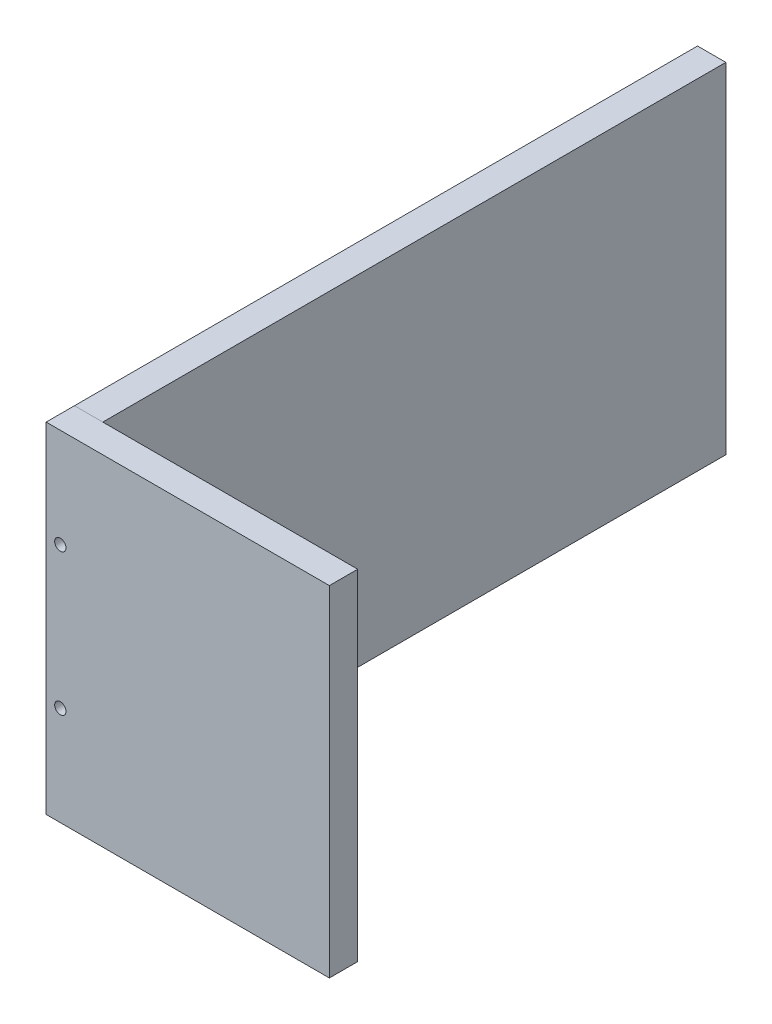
ISO-10303-21;
HEADER;
FILE_DESCRIPTION(('STEP AP214'),'2;1');
FILE_NAME('part.step','',(''),(''),'','','');
FILE_SCHEMA(('AUTOMOTIVE_DESIGN { 1 0 10303 214 1 1 1 1 }'));
ENDSEC;
DATA;
#1=APPLICATION_CONTEXT('core data for automotive mechanical design processes');
#2=APPLICATION_PROTOCOL_DEFINITION('international standard','automotive_design',2000,#1);
#3=PRODUCT_CONTEXT('',#1,'mechanical');
#4=PRODUCT('Part','Part','',(#3));
#5=PRODUCT_RELATED_PRODUCT_CATEGORY('part','',(#4));
#6=PRODUCT_DEFINITION_FORMATION('','',#4);
#7=PRODUCT_DEFINITION_CONTEXT('part definition',#1,'design');
#8=PRODUCT_DEFINITION('design','',#6,#7);
#9=PRODUCT_DEFINITION_SHAPE('','',#8);
#10=(LENGTH_UNIT() NAMED_UNIT(*) SI_UNIT(.MILLI.,.METRE.));
#11=(NAMED_UNIT(*) PLANE_ANGLE_UNIT() SI_UNIT($,.RADIAN.));
#12=(NAMED_UNIT(*) SI_UNIT($,.STERADIAN.) SOLID_ANGLE_UNIT());
#13=UNCERTAINTY_MEASURE_WITH_UNIT(LENGTH_MEASURE(1.E-05),#10,'distance_accuracy_value','');
#14=(GEOMETRIC_REPRESENTATION_CONTEXT(3) GLOBAL_UNCERTAINTY_ASSIGNED_CONTEXT((#13)) GLOBAL_UNIT_ASSIGNED_CONTEXT((#10,
#11,#12)) REPRESENTATION_CONTEXT('',''));
#15=CARTESIAN_POINT('',(0.,0.,0.));
#16=DIRECTION('',(0.,0.,1.));
#17=DIRECTION('',(1.,0.,0.));
#18=AXIS2_PLACEMENT_3D('',#15,#16,#17);
#19=CARTESIAN_POINT('',(0.,120.,0.));
#20=DIRECTION('',(0.,0.,-1.));
#21=DIRECTION('',(-1.,0.,0.));
#22=AXIS2_PLACEMENT_3D('',#19,#20,#21);
#23=PLANE('',#22);
#24=CARTESIAN_POINT('',(5.,85.,0.));
#25=DIRECTION('',(0.,0.,-1.));
#26=DIRECTION('',(-1.,0.,0.));
#27=AXIS2_PLACEMENT_3D('',#24,#25,#26);
#28=CIRCLE('',#27,2.);
#29=CARTESIAN_POINT('',(3.,85.,0.));
#30=VERTEX_POINT('',#29);
#31=EDGE_CURVE('E115',#30,#30,#28,.T.);
#32=ORIENTED_EDGE('',*,*,#31,.F.);
#33=EDGE_LOOP('',(#32));
#34=FACE_BOUND('',#33,.T.);
#35=CARTESIAN_POINT('',(5.,35.,0.));
#36=DIRECTION('',(0.,0.,-1.));
#37=DIRECTION('',(-1.,0.,0.));
#38=AXIS2_PLACEMENT_3D('',#35,#36,#37);
#39=CIRCLE('',#38,2.);
#40=CARTESIAN_POINT('',(3.,35.,0.));
#41=VERTEX_POINT('',#40);
#42=EDGE_CURVE('E133',#41,#41,#39,.T.);
#43=ORIENTED_EDGE('',*,*,#42,.F.);
#44=EDGE_LOOP('',(#43));
#45=FACE_BOUND('',#44,.T.);
#46=DIRECTION('',(1.,0.,0.));
#47=VECTOR('',#46,1.);
#48=CARTESIAN_POINT('',(0.,0.,0.));
#49=LINE('',#48,#47);
#50=CARTESIAN_POINT('',(0.,0.,0.));
#51=VERTEX_POINT('',#50);
#52=CARTESIAN_POINT('',(100.,0.,0.));
#53=VERTEX_POINT('',#52);
#54=EDGE_CURVE('E111',#51,#53,#49,.T.);
#55=ORIENTED_EDGE('',*,*,#54,.F.);
#56=DIRECTION('',(0.,-1.,0.));
#57=VECTOR('',#56,1.);
#58=CARTESIAN_POINT('',(0.,120.,0.));
#59=LINE('',#58,#57);
#60=CARTESIAN_POINT('',(0.,120.,0.));
#61=VERTEX_POINT('',#60);
#62=EDGE_CURVE('E12',#61,#51,#59,.T.);
#63=ORIENTED_EDGE('',*,*,#62,.F.);
#64=DIRECTION('',(1.,0.,0.));
#65=VECTOR('',#64,1.);
#66=CARTESIAN_POINT('',(0.,120.,0.));
#67=LINE('',#66,#65);
#68=CARTESIAN_POINT('',(100.,120.,0.));
#69=VERTEX_POINT('',#68);
#70=EDGE_CURVE('E105',#61,#69,#67,.T.);
#71=ORIENTED_EDGE('',*,*,#70,.T.);
#72=DIRECTION('',(0.,-1.,0.));
#73=VECTOR('',#72,1.);
#74=CARTESIAN_POINT('',(100.,120.,0.));
#75=LINE('',#74,#73);
#76=EDGE_CURVE('E48',#69,#53,#75,.T.);
#77=ORIENTED_EDGE('',*,*,#76,.T.);
#78=EDGE_LOOP('',(#55,#63,#71,#77));
#79=FACE_BOUND('',#78,.T.);
#80=ADVANCED_FACE('F45',(#34,#45,#79),#23,.T.);
#81=CARTESIAN_POINT('',(0.,120.,0.));
#82=DIRECTION('',(1.,0.,0.));
#83=DIRECTION('',(0.,0.,-1.));
#84=AXIS2_PLACEMENT_3D('',#81,#82,#83);
#85=PLANE('',#84);
#86=DIRECTION('',(0.,0.,1.));
#87=VECTOR('',#86,1.);
#88=CARTESIAN_POINT('',(0.,0.,0.));
#89=LINE('',#88,#87);
#90=CARTESIAN_POINT('',(0.,0.,10.));
#91=VERTEX_POINT('',#90);
#92=EDGE_CURVE('E78',#51,#91,#89,.T.);
#93=ORIENTED_EDGE('',*,*,#92,.T.);
#94=DIRECTION('',(0.,-1.,0.));
#95=VECTOR('',#94,1.);
#96=CARTESIAN_POINT('',(0.,120.,10.));
#97=LINE('',#96,#95);
#98=CARTESIAN_POINT('',(0.,120.,10.));
#99=VERTEX_POINT('',#98);
#100=EDGE_CURVE('E54',#99,#91,#97,.T.);
#101=ORIENTED_EDGE('',*,*,#100,.F.);
#102=DIRECTION('',(0.,0.,1.));
#103=VECTOR('',#102,1.);
#104=CARTESIAN_POINT('',(0.,120.,0.));
#105=LINE('',#104,#103);
#106=EDGE_CURVE('E95',#61,#99,#105,.T.);
#107=ORIENTED_EDGE('',*,*,#106,.F.);
#108=ORIENTED_EDGE('',*,*,#62,.T.);
#109=EDGE_LOOP('',(#93,#101,#107,#108));
#110=FACE_BOUND('',#109,.T.);
#111=ADVANCED_FACE('F122',(#110),#85,.F.);
#112=CARTESIAN_POINT('',(0.,120.,10.));
#113=DIRECTION('',(0.,0.,-1.));
#114=DIRECTION('',(-1.,0.,0.));
#115=AXIS2_PLACEMENT_3D('',#112,#113,#114);
#116=PLANE('',#115);
#117=CARTESIAN_POINT('',(5.,85.,10.));
#118=DIRECTION('',(0.,0.,1.));
#119=DIRECTION('',(1.,0.,0.));
#120=AXIS2_PLACEMENT_3D('',#117,#118,#119);
#121=CIRCLE('',#120,2.);
#122=CARTESIAN_POINT('',(7.,85.,10.));
#123=VERTEX_POINT('',#122);
#124=EDGE_CURVE('E135',#123,#123,#121,.T.);
#125=ORIENTED_EDGE('',*,*,#124,.F.);
#126=EDGE_LOOP('',(#125));
#127=FACE_BOUND('',#126,.T.);
#128=CARTESIAN_POINT('',(5.,35.,10.));
#129=DIRECTION('',(0.,0.,1.));
#130=DIRECTION('',(1.,0.,0.));
#131=AXIS2_PLACEMENT_3D('',#128,#129,#130);
#132=CIRCLE('',#131,2.);
#133=CARTESIAN_POINT('',(7.,35.,10.));
#134=VERTEX_POINT('',#133);
#135=EDGE_CURVE('E138',#134,#134,#132,.T.);
#136=ORIENTED_EDGE('',*,*,#135,.F.);
#137=EDGE_LOOP('',(#136));
#138=FACE_BOUND('',#137,.T.);
#139=DIRECTION('',(1.,0.,0.));
#140=VECTOR('',#139,1.);
#141=CARTESIAN_POINT('',(0.,0.,10.));
#142=LINE('',#141,#140);
#143=CARTESIAN_POINT('',(100.,0.,10.));
#144=VERTEX_POINT('',#143);
#145=EDGE_CURVE('E102',#91,#144,#142,.T.);
#146=ORIENTED_EDGE('',*,*,#145,.T.);
#147=DIRECTION('',(0.,-1.,0.));
#148=VECTOR('',#147,1.);
#149=CARTESIAN_POINT('',(100.,120.,10.));
#150=LINE('',#149,#148);
#151=CARTESIAN_POINT('',(100.,120.,10.));
#152=VERTEX_POINT('',#151);
#153=EDGE_CURVE('E99',#152,#144,#150,.T.);
#154=ORIENTED_EDGE('',*,*,#153,.F.);
#155=DIRECTION('',(1.,0.,0.));
#156=VECTOR('',#155,1.);
#157=CARTESIAN_POINT('',(0.,120.,10.));
#158=LINE('',#157,#156);
#159=EDGE_CURVE('E90',#99,#152,#158,.T.);
#160=ORIENTED_EDGE('',*,*,#159,.F.);
#161=ORIENTED_EDGE('',*,*,#100,.T.);
#162=EDGE_LOOP('',(#146,#154,#160,#161));
#163=FACE_BOUND('',#162,.T.);
#164=ADVANCED_FACE('F100',(#127,#138,#163),#116,.F.);
#165=CARTESIAN_POINT('',(100.,120.,0.));
#166=DIRECTION('',(1.,0.,0.));
#167=DIRECTION('',(0.,0.,-1.));
#168=AXIS2_PLACEMENT_3D('',#165,#166,#167);
#169=PLANE('',#168);
#170=DIRECTION('',(0.,0.,1.));
#171=VECTOR('',#170,1.);
#172=CARTESIAN_POINT('',(100.,0.,0.));
#173=LINE('',#172,#171);
#174=EDGE_CURVE('E114',#53,#144,#173,.T.);
#175=ORIENTED_EDGE('',*,*,#174,.F.);
#176=ORIENTED_EDGE('',*,*,#76,.F.);
#177=DIRECTION('',(0.,0.,1.));
#178=VECTOR('',#177,1.);
#179=CARTESIAN_POINT('',(100.,120.,0.));
#180=LINE('',#179,#178);
#181=EDGE_CURVE('E94',#69,#152,#180,.T.);
#182=ORIENTED_EDGE('',*,*,#181,.T.);
#183=ORIENTED_EDGE('',*,*,#153,.T.);
#184=EDGE_LOOP('',(#175,#176,#182,#183));
#185=FACE_BOUND('',#184,.T.);
#186=ADVANCED_FACE('F104',(#185),#169,.T.);
#187=CARTESIAN_POINT('',(0.,120.,0.));
#188=DIRECTION('',(0.,-1.,0.));
#189=DIRECTION('',(0.,0.,-1.));
#190=AXIS2_PLACEMENT_3D('',#187,#188,#189);
#191=PLANE('',#190);
#192=ORIENTED_EDGE('',*,*,#70,.F.);
#193=ORIENTED_EDGE('',*,*,#106,.T.);
#194=ORIENTED_EDGE('',*,*,#159,.T.);
#195=ORIENTED_EDGE('',*,*,#181,.F.);
#196=EDGE_LOOP('',(#192,#193,#194,#195));
#197=FACE_BOUND('',#196,.T.);
#198=ADVANCED_FACE('F93',(#197),#191,.F.);
#199=CARTESIAN_POINT('',(0.,0.,0.));
#200=DIRECTION('',(0.,-1.,0.));
#201=DIRECTION('',(0.,0.,-1.));
#202=AXIS2_PLACEMENT_3D('',#199,#200,#201);
#203=PLANE('',#202);
#204=ORIENTED_EDGE('',*,*,#54,.T.);
#205=ORIENTED_EDGE('',*,*,#174,.T.);
#206=ORIENTED_EDGE('',*,*,#145,.F.);
#207=ORIENTED_EDGE('',*,*,#92,.F.);
#208=EDGE_LOOP('',(#204,#205,#206,#207));
#209=FACE_BOUND('',#208,.T.);
#210=ADVANCED_FACE('F120',(#209),#203,.T.);
#211=CARTESIAN_POINT('',(5.,35.,-20.));
#212=DIRECTION('',(0.,0.,1.));
#213=DIRECTION('',(1.,0.,0.));
#214=AXIS2_PLACEMENT_3D('',#211,#212,#213);
#215=CYLINDRICAL_SURFACE('',#214,2.);
#216=ORIENTED_EDGE('',*,*,#42,.T.);
#217=EDGE_LOOP('',(#216));
#218=FACE_BOUND('',#217,.T.);
#219=ORIENTED_EDGE('',*,*,#135,.T.);
#220=EDGE_LOOP('',(#219));
#221=FACE_BOUND('',#220,.T.);
#222=ADVANCED_FACE('F144',(#218,#221),#215,.F.);
#223=CARTESIAN_POINT('',(5.,85.,-20.));
#224=DIRECTION('',(0.,0.,1.));
#225=DIRECTION('',(1.,0.,0.));
#226=AXIS2_PLACEMENT_3D('',#223,#224,#225);
#227=CYLINDRICAL_SURFACE('',#226,2.);
#228=ORIENTED_EDGE('',*,*,#31,.T.);
#229=EDGE_LOOP('',(#228));
#230=FACE_BOUND('',#229,.T.);
#231=ORIENTED_EDGE('',*,*,#124,.T.);
#232=EDGE_LOOP('',(#231));
#233=FACE_BOUND('',#232,.T.);
#234=ADVANCED_FACE('F160',(#230,#233),#227,.F.);
#235=CLOSED_SHELL('',(#80,#111,#164,#186,#198,#210,#222,#234));
#236=MANIFOLD_SOLID_BREP('B2',#235);
#237=CARTESIAN_POINT('',(0.,120.,0.));
#238=DIRECTION('',(0.,0.,-1.));
#239=DIRECTION('',(-1.,0.,0.));
#240=AXIS2_PLACEMENT_3D('',#237,#238,#239);
#241=PLANE('',#240);
#242=CARTESIAN_POINT('',(5.,85.,0.));
#243=DIRECTION('',(0.,0.,-1.));
#244=DIRECTION('',(-1.,0.,0.));
#245=AXIS2_PLACEMENT_3D('',#242,#243,#244);
#246=CIRCLE('',#245,2.);
#247=CARTESIAN_POINT('',(3.,85.,0.));
#248=VERTEX_POINT('',#247);
#249=EDGE_CURVE('E214',#248,#248,#246,.T.);
#250=ORIENTED_EDGE('',*,*,#249,.T.);
#251=EDGE_LOOP('',(#250));
#252=FACE_BOUND('',#251,.T.);
#253=CARTESIAN_POINT('',(5.,35.,0.));
#254=DIRECTION('',(0.,0.,-1.));
#255=DIRECTION('',(-1.,0.,0.));
#256=AXIS2_PLACEMENT_3D('',#253,#254,#255);
#257=CIRCLE('',#256,2.);
#258=CARTESIAN_POINT('',(3.,35.,0.));
#259=VERTEX_POINT('',#258);
#260=EDGE_CURVE('E286',#259,#259,#257,.T.);
#261=ORIENTED_EDGE('',*,*,#260,.T.);
#262=EDGE_LOOP('',(#261));
#263=FACE_BOUND('',#262,.T.);
#264=DIRECTION('',(1.,0.,0.));
#265=VECTOR('',#264,1.);
#266=CARTESIAN_POINT('',(0.,0.,0.));
#267=LINE('',#266,#265);
#268=CARTESIAN_POINT('',(0.,0.,0.));
#269=VERTEX_POINT('',#268);
#270=CARTESIAN_POINT('',(9.99999999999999,0.,0.));
#271=VERTEX_POINT('',#270);
#272=EDGE_CURVE('E277',#269,#271,#267,.T.);
#273=ORIENTED_EDGE('',*,*,#272,.T.);
#274=DIRECTION('',(0.,-1.,0.));
#275=VECTOR('',#274,1.);
#276=CARTESIAN_POINT('',(9.99999999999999,120.,0.));
#277=LINE('',#276,#275);
#278=CARTESIAN_POINT('',(9.99999999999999,120.,0.));
#279=VERTEX_POINT('',#278);
#280=EDGE_CURVE('E43',#279,#271,#277,.T.);
#281=ORIENTED_EDGE('',*,*,#280,.F.);
#282=DIRECTION('',(1.,0.,0.));
#283=VECTOR('',#282,1.);
#284=CARTESIAN_POINT('',(0.,120.,0.));
#285=LINE('',#284,#283);
#286=CARTESIAN_POINT('',(0.,120.,0.));
#287=VERTEX_POINT('',#286);
#288=EDGE_CURVE('E262',#287,#279,#285,.T.);
#289=ORIENTED_EDGE('',*,*,#288,.F.);
#290=DIRECTION('',(0.,-1.,0.));
#291=VECTOR('',#290,1.);
#292=CARTESIAN_POINT('',(0.,120.,0.));
#293=LINE('',#292,#291);
#294=EDGE_CURVE('E229',#287,#269,#293,.T.);
#295=ORIENTED_EDGE('',*,*,#294,.T.);
#296=EDGE_LOOP('',(#273,#281,#289,#295));
#297=FACE_BOUND('',#296,.T.);
#298=ADVANCED_FACE('F211',(#252,#263,#297),#241,.F.);
#299=CARTESIAN_POINT('',(9.99999999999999,120.,0.));
#300=DIRECTION('',(-1.,0.,0.));
#301=DIRECTION('',(0.,0.,1.));
#302=AXIS2_PLACEMENT_3D('',#299,#300,#301);
#303=PLANE('',#302);
#304=DIRECTION('',(0.,0.,-1.));
#305=VECTOR('',#304,1.);
#306=CARTESIAN_POINT('',(9.99999999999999,0.,0.));
#307=LINE('',#306,#305);
#308=CARTESIAN_POINT('',(10.,0.,-220.));
#309=VERTEX_POINT('',#308);
#310=EDGE_CURVE('E267',#271,#309,#307,.T.);
#311=ORIENTED_EDGE('',*,*,#310,.T.);
#312=DIRECTION('',(0.,-1.,0.));
#313=VECTOR('',#312,1.);
#314=CARTESIAN_POINT('',(10.,120.,-220.));
#315=LINE('',#314,#313);
#316=CARTESIAN_POINT('',(10.,120.,-220.));
#317=VERTEX_POINT('',#316);
#318=EDGE_CURVE('E220',#317,#309,#315,.T.);
#319=ORIENTED_EDGE('',*,*,#318,.F.);
#320=DIRECTION('',(0.,0.,-1.));
#321=VECTOR('',#320,1.);
#322=CARTESIAN_POINT('',(9.99999999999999,120.,0.));
#323=LINE('',#322,#321);
#324=EDGE_CURVE('E254',#279,#317,#323,.T.);
#325=ORIENTED_EDGE('',*,*,#324,.F.);
#326=ORIENTED_EDGE('',*,*,#280,.T.);
#327=EDGE_LOOP('',(#311,#319,#325,#326));
#328=FACE_BOUND('',#327,.T.);
#329=ADVANCED_FACE('F266',(#328),#303,.F.);
#330=CARTESIAN_POINT('',(0.,120.,-220.));
#331=DIRECTION('',(0.,0.,-1.));
#332=DIRECTION('',(-1.,0.,0.));
#333=AXIS2_PLACEMENT_3D('',#330,#331,#332);
#334=PLANE('',#333);
#335=DIRECTION('',(1.,0.,0.));
#336=VECTOR('',#335,1.);
#337=CARTESIAN_POINT('',(0.,0.,-220.));
#338=LINE('',#337,#336);
#339=CARTESIAN_POINT('',(0.,0.,-220.));
#340=VERTEX_POINT('',#339);
#341=EDGE_CURVE('E280',#340,#309,#338,.T.);
#342=ORIENTED_EDGE('',*,*,#341,.F.);
#343=DIRECTION('',(0.,-1.,0.));
#344=VECTOR('',#343,1.);
#345=CARTESIAN_POINT('',(0.,120.,-220.));
#346=LINE('',#345,#344);
#347=CARTESIAN_POINT('',(0.,120.,-220.));
#348=VERTEX_POINT('',#347);
#349=EDGE_CURVE('E243',#348,#340,#346,.T.);
#350=ORIENTED_EDGE('',*,*,#349,.F.);
#351=DIRECTION('',(1.,0.,0.));
#352=VECTOR('',#351,1.);
#353=CARTESIAN_POINT('',(0.,120.,-220.));
#354=LINE('',#353,#352);
#355=EDGE_CURVE('E261',#348,#317,#354,.T.);
#356=ORIENTED_EDGE('',*,*,#355,.T.);
#357=ORIENTED_EDGE('',*,*,#318,.T.);
#358=EDGE_LOOP('',(#342,#350,#356,#357));
#359=FACE_BOUND('',#358,.T.);
#360=ADVANCED_FACE('F271',(#359),#334,.T.);
#361=CARTESIAN_POINT('',(0.,120.,0.));
#362=DIRECTION('',(-1.,0.,0.));
#363=DIRECTION('',(0.,0.,1.));
#364=AXIS2_PLACEMENT_3D('',#361,#362,#363);
#365=PLANE('',#364);
#366=DIRECTION('',(0.,0.,-1.));
#367=VECTOR('',#366,1.);
#368=CARTESIAN_POINT('',(0.,0.,0.));
#369=LINE('',#368,#367);
#370=EDGE_CURVE('E282',#269,#340,#369,.T.);
#371=ORIENTED_EDGE('',*,*,#370,.F.);
#372=ORIENTED_EDGE('',*,*,#294,.F.);
#373=DIRECTION('',(0.,0.,-1.));
#374=VECTOR('',#373,1.);
#375=CARTESIAN_POINT('',(0.,120.,0.));
#376=LINE('',#375,#374);
#377=EDGE_CURVE('E272',#287,#348,#376,.T.);
#378=ORIENTED_EDGE('',*,*,#377,.T.);
#379=ORIENTED_EDGE('',*,*,#349,.T.);
#380=EDGE_LOOP('',(#371,#372,#378,#379));
#381=FACE_BOUND('',#380,.T.);
#382=ADVANCED_FACE('F323',(#381),#365,.T.);
#383=CARTESIAN_POINT('',(0.,120.,0.));
#384=DIRECTION('',(0.,1.,0.));
#385=DIRECTION('',(0.,0.,1.));
#386=AXIS2_PLACEMENT_3D('',#383,#384,#385);
#387=PLANE('',#386);
#388=ORIENTED_EDGE('',*,*,#288,.T.);
#389=ORIENTED_EDGE('',*,*,#324,.T.);
#390=ORIENTED_EDGE('',*,*,#355,.F.);
#391=ORIENTED_EDGE('',*,*,#377,.F.);
#392=EDGE_LOOP('',(#388,#389,#390,#391));
#393=FACE_BOUND('',#392,.T.);
#394=ADVANCED_FACE('F258',(#393),#387,.T.);
#395=CARTESIAN_POINT('',(0.,0.,0.));
#396=DIRECTION('',(0.,1.,0.));
#397=DIRECTION('',(0.,0.,1.));
#398=AXIS2_PLACEMENT_3D('',#395,#396,#397);
#399=PLANE('',#398);
#400=ORIENTED_EDGE('',*,*,#272,.F.);
#401=ORIENTED_EDGE('',*,*,#370,.T.);
#402=ORIENTED_EDGE('',*,*,#341,.T.);
#403=ORIENTED_EDGE('',*,*,#310,.F.);
#404=EDGE_LOOP('',(#400,#401,#402,#403));
#405=FACE_BOUND('',#404,.T.);
#406=ADVANCED_FACE('F306',(#405),#399,.F.);
#407=CARTESIAN_POINT('',(5.,35.,-20.));
#408=DIRECTION('',(0.,0.,1.));
#409=DIRECTION('',(1.,0.,0.));
#410=AXIS2_PLACEMENT_3D('',#407,#408,#409);
#411=CYLINDRICAL_SURFACE('',#410,2.);
#412=CARTESIAN_POINT('',(5.,35.,-20.));
#413=DIRECTION('',(0.,0.,1.));
#414=DIRECTION('',(1.,0.,0.));
#415=AXIS2_PLACEMENT_3D('',#412,#413,#414);
#416=CIRCLE('',#415,2.);
#417=CARTESIAN_POINT('',(7.,35.,-20.));
#418=VERTEX_POINT('',#417);
#419=EDGE_CURVE('E293',#418,#418,#416,.T.);
#420=ORIENTED_EDGE('',*,*,#419,.F.);
#421=EDGE_LOOP('',(#420));
#422=FACE_BOUND('',#421,.T.);
#423=ORIENTED_EDGE('',*,*,#260,.F.);
#424=EDGE_LOOP('',(#423));
#425=FACE_BOUND('',#424,.T.);
#426=ADVANCED_FACE('F303',(#422,#425),#411,.F.);
#427=CARTESIAN_POINT('',(5.,35.,-20.));
#428=DIRECTION('',(0.,0.,1.));
#429=DIRECTION('',(1.,0.,0.));
#430=AXIS2_PLACEMENT_3D('',#427,#428,#429);
#431=PLANE('',#430);
#432=ORIENTED_EDGE('',*,*,#419,.T.);
#433=EDGE_LOOP('',(#432));
#434=FACE_BOUND('',#433,.T.);
#435=ADVANCED_FACE('F301',(#434),#431,.T.);
#436=CARTESIAN_POINT('',(5.,85.,-20.));
#437=DIRECTION('',(0.,0.,1.));
#438=DIRECTION('',(1.,0.,0.));
#439=AXIS2_PLACEMENT_3D('',#436,#437,#438);
#440=CYLINDRICAL_SURFACE('',#439,2.);
#441=CARTESIAN_POINT('',(5.,85.,-20.));
#442=DIRECTION('',(0.,0.,1.));
#443=DIRECTION('',(1.,0.,0.));
#444=AXIS2_PLACEMENT_3D('',#441,#442,#443);
#445=CIRCLE('',#444,2.);
#446=CARTESIAN_POINT('',(7.,85.,-20.));
#447=VERTEX_POINT('',#446);
#448=EDGE_CURVE('E288',#447,#447,#445,.T.);
#449=ORIENTED_EDGE('',*,*,#448,.F.);
#450=EDGE_LOOP('',(#449));
#451=FACE_BOUND('',#450,.T.);
#452=ORIENTED_EDGE('',*,*,#249,.F.);
#453=EDGE_LOOP('',(#452));
#454=FACE_BOUND('',#453,.T.);
#455=ADVANCED_FACE('F312',(#451,#454),#440,.F.);
#456=CARTESIAN_POINT('',(5.,85.,-20.));
#457=DIRECTION('',(0.,0.,1.));
#458=DIRECTION('',(1.,0.,0.));
#459=AXIS2_PLACEMENT_3D('',#456,#457,#458);
#460=PLANE('',#459);
#461=ORIENTED_EDGE('',*,*,#448,.T.);
#462=EDGE_LOOP('',(#461));
#463=FACE_BOUND('',#462,.T.);
#464=ADVANCED_FACE('F376',(#463),#460,.T.);
#465=CLOSED_SHELL('',(#298,#329,#360,#382,#394,#406,#426,#435,#455,#464));
#466=MANIFOLD_SOLID_BREP('B6',#465);
#467=ADVANCED_BREP_SHAPE_REPRESENTATION('',(#18,#236,#466),#14);
#468=SHAPE_DEFINITION_REPRESENTATION(#9,#467);
ENDSEC;
END-ISO-10303-21;
